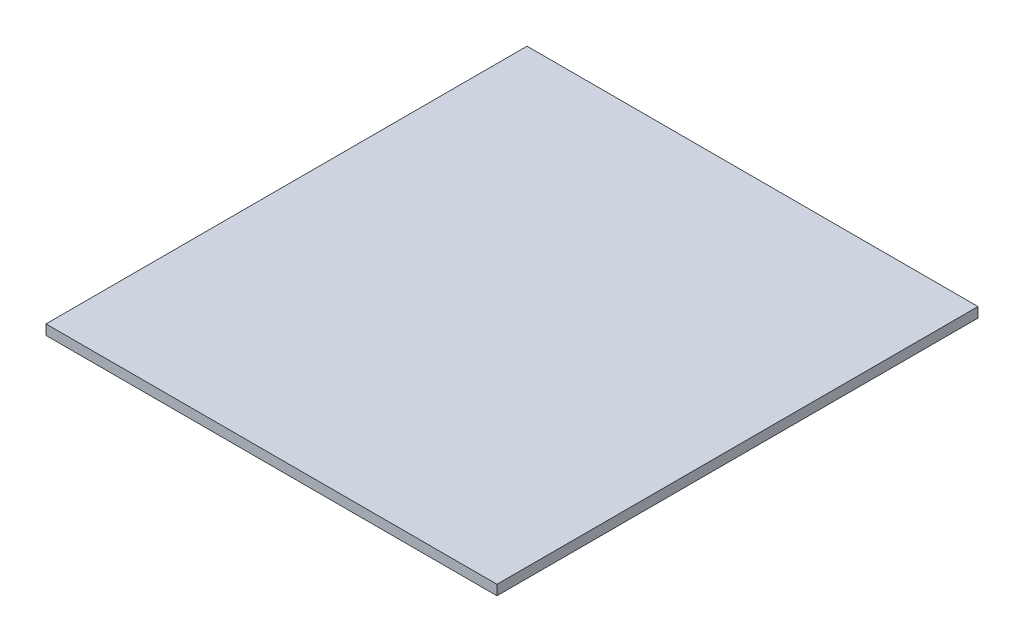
ISO-10303-21;
HEADER;
FILE_DESCRIPTION(('STEP AP214'),'2;1');
FILE_NAME('part.step','',(''),(''),'','','');
FILE_SCHEMA(('AUTOMOTIVE_DESIGN { 1 0 10303 214 1 1 1 1 }'));
ENDSEC;
DATA;
#1=APPLICATION_CONTEXT('core data for automotive mechanical design processes');
#2=APPLICATION_PROTOCOL_DEFINITION('international standard','automotive_design',2000,#1);
#3=PRODUCT_CONTEXT('',#1,'mechanical');
#4=PRODUCT('Part','Part','',(#3));
#5=PRODUCT_RELATED_PRODUCT_CATEGORY('part','',(#4));
#6=PRODUCT_DEFINITION_FORMATION('','',#4);
#7=PRODUCT_DEFINITION_CONTEXT('part definition',#1,'design');
#8=PRODUCT_DEFINITION('design','',#6,#7);
#9=PRODUCT_DEFINITION_SHAPE('','',#8);
#10=(LENGTH_UNIT() NAMED_UNIT(*) SI_UNIT(.MILLI.,.METRE.));
#11=(NAMED_UNIT(*) PLANE_ANGLE_UNIT() SI_UNIT($,.RADIAN.));
#12=(NAMED_UNIT(*) SI_UNIT($,.STERADIAN.) SOLID_ANGLE_UNIT());
#13=UNCERTAINTY_MEASURE_WITH_UNIT(LENGTH_MEASURE(1.E-05),#10,'distance_accuracy_value','');
#14=(GEOMETRIC_REPRESENTATION_CONTEXT(3) GLOBAL_UNCERTAINTY_ASSIGNED_CONTEXT((#13)) GLOBAL_UNIT_ASSIGNED_CONTEXT((#10,
#11,#12)) REPRESENTATION_CONTEXT('',''));
#15=CARTESIAN_POINT('',(0.,0.,0.));
#16=DIRECTION('',(0.,0.,1.));
#17=DIRECTION('',(1.,0.,0.));
#18=AXIS2_PLACEMENT_3D('',#15,#16,#17);
#19=CARTESIAN_POINT('',(571.5,25.4,609.6));
#20=DIRECTION('',(-1.,0.,0.));
#21=DIRECTION('',(0.,0.,1.));
#22=AXIS2_PLACEMENT_3D('',#19,#20,#21);
#23=PLANE('',#22);
#24=DIRECTION('',(0.,0.,-1.));
#25=VECTOR('',#24,1.);
#26=CARTESIAN_POINT('',(571.5,0.,609.6));
#27=LINE('',#26,#25);
#28=CARTESIAN_POINT('',(571.5,0.,609.6));
#29=VERTEX_POINT('',#28);
#30=CARTESIAN_POINT('',(571.5,0.,-609.6));
#31=VERTEX_POINT('',#30);
#32=EDGE_CURVE('E115',#29,#31,#27,.T.);
#33=ORIENTED_EDGE('',*,*,#32,.T.);
#34=DIRECTION('',(0.,-1.,0.));
#35=VECTOR('',#34,1.);
#36=CARTESIAN_POINT('',(571.5,25.4,-609.6));
#37=LINE('',#36,#35);
#38=CARTESIAN_POINT('',(571.5,25.4,-609.6));
#39=VERTEX_POINT('',#38);
#40=EDGE_CURVE('E11',#39,#31,#37,.T.);
#41=ORIENTED_EDGE('',*,*,#40,.F.);
#42=DIRECTION('',(0.,0.,-1.));
#43=VECTOR('',#42,1.);
#44=CARTESIAN_POINT('',(571.5,25.4,609.6));
#45=LINE('',#44,#43);
#46=CARTESIAN_POINT('',(571.5,25.4,609.6));
#47=VERTEX_POINT('',#46);
#48=EDGE_CURVE('E99',#47,#39,#45,.T.);
#49=ORIENTED_EDGE('',*,*,#48,.F.);
#50=DIRECTION('',(0.,-1.,0.));
#51=VECTOR('',#50,1.);
#52=CARTESIAN_POINT('',(571.5,25.4,609.6));
#53=LINE('',#52,#51);
#54=EDGE_CURVE('E111',#47,#29,#53,.T.);
#55=ORIENTED_EDGE('',*,*,#54,.T.);
#56=EDGE_LOOP('',(#33,#41,#49,#55));
#57=FACE_BOUND('',#56,.T.);
#58=ADVANCED_FACE('F47',(#57),#23,.F.);
#59=CARTESIAN_POINT('',(-571.5,25.4,-609.6));
#60=DIRECTION('',(0.,0.,1.));
#61=DIRECTION('',(1.,0.,0.));
#62=AXIS2_PLACEMENT_3D('',#59,#60,#61);
#63=PLANE('',#62);
#64=DIRECTION('',(-1.,0.,0.));
#65=VECTOR('',#64,1.);
#66=CARTESIAN_POINT('',(-571.5,0.,-609.6));
#67=LINE('',#66,#65);
#68=CARTESIAN_POINT('',(-571.5,0.,-609.6));
#69=VERTEX_POINT('',#68);
#70=EDGE_CURVE('E104',#31,#69,#67,.T.);
#71=ORIENTED_EDGE('',*,*,#70,.T.);
#72=DIRECTION('',(0.,-1.,0.));
#73=VECTOR('',#72,1.);
#74=CARTESIAN_POINT('',(-571.5,25.4,-609.6));
#75=LINE('',#74,#73);
#76=CARTESIAN_POINT('',(-571.5,25.4,-609.6));
#77=VERTEX_POINT('',#76);
#78=EDGE_CURVE('E56',#77,#69,#75,.T.);
#79=ORIENTED_EDGE('',*,*,#78,.F.);
#80=DIRECTION('',(-1.,0.,0.));
#81=VECTOR('',#80,1.);
#82=CARTESIAN_POINT('',(-571.5,25.4,-609.6));
#83=LINE('',#82,#81);
#84=EDGE_CURVE('E94',#39,#77,#83,.T.);
#85=ORIENTED_EDGE('',*,*,#84,.F.);
#86=ORIENTED_EDGE('',*,*,#40,.T.);
#87=EDGE_LOOP('',(#71,#79,#85,#86));
#88=FACE_BOUND('',#87,.T.);
#89=ADVANCED_FACE('F103',(#88),#63,.F.);
#90=CARTESIAN_POINT('',(-571.5,25.4,609.6));
#91=DIRECTION('',(1.,0.,0.));
#92=DIRECTION('',(0.,0.,-1.));
#93=AXIS2_PLACEMENT_3D('',#90,#91,#92);
#94=PLANE('',#93);
#95=DIRECTION('',(0.,0.,1.));
#96=VECTOR('',#95,1.);
#97=CARTESIAN_POINT('',(-571.5,0.,609.6));
#98=LINE('',#97,#96);
#99=CARTESIAN_POINT('',(-571.5,0.,609.6));
#100=VERTEX_POINT('',#99);
#101=EDGE_CURVE('E81',#69,#100,#98,.T.);
#102=ORIENTED_EDGE('',*,*,#101,.T.);
#103=DIRECTION('',(0.,-1.,0.));
#104=VECTOR('',#103,1.);
#105=CARTESIAN_POINT('',(-571.5,25.4,609.6));
#106=LINE('',#105,#104);
#107=CARTESIAN_POINT('',(-571.5,25.4,609.6));
#108=VERTEX_POINT('',#107);
#109=EDGE_CURVE('E106',#108,#100,#106,.T.);
#110=ORIENTED_EDGE('',*,*,#109,.F.);
#111=DIRECTION('',(0.,0.,1.));
#112=VECTOR('',#111,1.);
#113=CARTESIAN_POINT('',(-571.5,25.4,609.6));
#114=LINE('',#113,#112);
#115=EDGE_CURVE('E97',#77,#108,#114,.T.);
#116=ORIENTED_EDGE('',*,*,#115,.F.);
#117=ORIENTED_EDGE('',*,*,#78,.T.);
#118=EDGE_LOOP('',(#102,#110,#116,#117));
#119=FACE_BOUND('',#118,.T.);
#120=ADVANCED_FACE('F107',(#119),#94,.F.);
#121=CARTESIAN_POINT('',(-571.5,25.4,609.6));
#122=DIRECTION('',(0.,0.,-1.));
#123=DIRECTION('',(-1.,0.,0.));
#124=AXIS2_PLACEMENT_3D('',#121,#122,#123);
#125=PLANE('',#124);
#126=DIRECTION('',(1.,0.,0.));
#127=VECTOR('',#126,1.);
#128=CARTESIAN_POINT('',(-571.5,0.,609.6));
#129=LINE('',#128,#127);
#130=EDGE_CURVE('E87',#100,#29,#129,.T.);
#131=ORIENTED_EDGE('',*,*,#130,.T.);
#132=ORIENTED_EDGE('',*,*,#54,.F.);
#133=DIRECTION('',(1.,0.,0.));
#134=VECTOR('',#133,1.);
#135=CARTESIAN_POINT('',(-571.5,25.4,609.6));
#136=LINE('',#135,#134);
#137=EDGE_CURVE('E64',#108,#47,#136,.T.);
#138=ORIENTED_EDGE('',*,*,#137,.F.);
#139=ORIENTED_EDGE('',*,*,#109,.T.);
#140=EDGE_LOOP('',(#131,#132,#138,#139));
#141=FACE_BOUND('',#140,.T.);
#142=ADVANCED_FACE('F128',(#141),#125,.F.);
#143=CARTESIAN_POINT('',(0.,25.4,0.));
#144=DIRECTION('',(0.,-1.,0.));
#145=DIRECTION('',(0.,0.,-1.));
#146=AXIS2_PLACEMENT_3D('',#143,#144,#145);
#147=PLANE('',#146);
#148=ORIENTED_EDGE('',*,*,#48,.T.);
#149=ORIENTED_EDGE('',*,*,#84,.T.);
#150=ORIENTED_EDGE('',*,*,#115,.T.);
#151=ORIENTED_EDGE('',*,*,#137,.T.);
#152=EDGE_LOOP('',(#148,#149,#150,#151));
#153=FACE_BOUND('',#152,.T.);
#154=ADVANCED_FACE('F95',(#153),#147,.F.);
#155=CARTESIAN_POINT('',(0.,0.,0.));
#156=DIRECTION('',(0.,-1.,0.));
#157=DIRECTION('',(0.,0.,-1.));
#158=AXIS2_PLACEMENT_3D('',#155,#156,#157);
#159=PLANE('',#158);
#160=ORIENTED_EDGE('',*,*,#32,.F.);
#161=ORIENTED_EDGE('',*,*,#130,.F.);
#162=ORIENTED_EDGE('',*,*,#101,.F.);
#163=ORIENTED_EDGE('',*,*,#70,.F.);
#164=EDGE_LOOP('',(#160,#161,#162,#163));
#165=FACE_BOUND('',#164,.T.);
#166=ADVANCED_FACE('F131',(#165),#159,.T.);
#167=CLOSED_SHELL('',(#58,#89,#120,#142,#154,#166));
#168=MANIFOLD_SOLID_BREP('B2',#167);
#169=ADVANCED_BREP_SHAPE_REPRESENTATION('',(#18,#168),#14);
#170=SHAPE_DEFINITION_REPRESENTATION(#9,#169);
ENDSEC;
END-ISO-10303-21;
